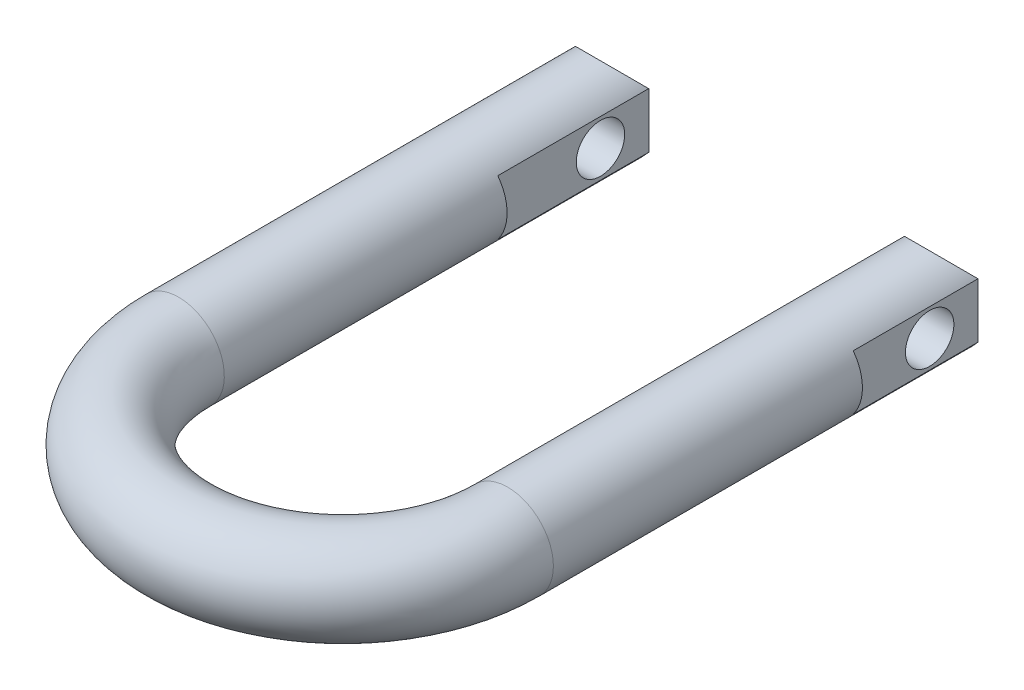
ISO-10303-21;
HEADER;
FILE_DESCRIPTION(('STEP AP214'),'2;1');
FILE_NAME('part.step','',(''),(''),'','','');
FILE_SCHEMA(('AUTOMOTIVE_DESIGN { 1 0 10303 214 1 1 1 1 }'));
ENDSEC;
DATA;
#1=APPLICATION_CONTEXT('core data for automotive mechanical design processes');
#2=APPLICATION_PROTOCOL_DEFINITION('international standard','automotive_design',2000,#1);
#3=PRODUCT_CONTEXT('',#1,'mechanical');
#4=PRODUCT('Part','Part','',(#3));
#5=PRODUCT_RELATED_PRODUCT_CATEGORY('part','',(#4));
#6=PRODUCT_DEFINITION_FORMATION('','',#4);
#7=PRODUCT_DEFINITION_CONTEXT('part definition',#1,'design');
#8=PRODUCT_DEFINITION('design','',#6,#7);
#9=PRODUCT_DEFINITION_SHAPE('','',#8);
#10=(LENGTH_UNIT() NAMED_UNIT(*) SI_UNIT(.MILLI.,.METRE.));
#11=(NAMED_UNIT(*) PLANE_ANGLE_UNIT() SI_UNIT($,.RADIAN.));
#12=(NAMED_UNIT(*) SI_UNIT($,.STERADIAN.) SOLID_ANGLE_UNIT());
#13=UNCERTAINTY_MEASURE_WITH_UNIT(LENGTH_MEASURE(1.E-05),#10,'distance_accuracy_value','');
#14=(GEOMETRIC_REPRESENTATION_CONTEXT(3) GLOBAL_UNCERTAINTY_ASSIGNED_CONTEXT((#13)) GLOBAL_UNIT_ASSIGNED_CONTEXT((#10,
#11,#12)) REPRESENTATION_CONTEXT('',''));
#15=CARTESIAN_POINT('',(0.,0.,0.));
#16=DIRECTION('',(0.,0.,1.));
#17=DIRECTION('',(1.,0.,0.));
#18=AXIS2_PLACEMENT_3D('',#15,#16,#17);
#19=CARTESIAN_POINT('',(97.3,-13.9,37.));
#20=DIRECTION('',(-1.,0.,0.));
#21=DIRECTION('',(0.,-1.,0.));
#22=AXIS2_PLACEMENT_3D('',#19,#20,#21);
#23=PLANE('',#22);
#24=DIRECTION('',(0.,0.,-1.));
#25=VECTOR('',#24,1.);
#26=CARTESIAN_POINT('',(97.3,-13.2999060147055,186.6));
#27=LINE('',#26,#25);
#28=CARTESIAN_POINT('',(97.3,-13.2999060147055,37.));
#29=VERTEX_POINT('',#28);
#30=CARTESIAN_POINT('',(97.3,-13.2999060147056,-23.4));
#31=VERTEX_POINT('',#30);
#32=EDGE_CURVE('E127',#29,#31,#27,.T.);
#33=ORIENTED_EDGE('',*,*,#32,.T.);
#34=DIRECTION('',(0.,1.,0.));
#35=VECTOR('',#34,1.);
#36=CARTESIAN_POINT('',(97.3,-13.9,-23.4));
#37=LINE('',#36,#35);
#38=CARTESIAN_POINT('',(97.3,13.2999060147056,-23.4));
#39=VERTEX_POINT('',#38);
#40=EDGE_CURVE('E141',#31,#39,#37,.T.);
#41=ORIENTED_EDGE('',*,*,#40,.T.);
#42=DIRECTION('',(0.,0.,-1.));
#43=VECTOR('',#42,1.);
#44=CARTESIAN_POINT('',(97.3,13.2999060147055,186.6));
#45=LINE('',#44,#43);
#46=CARTESIAN_POINT('',(97.3,13.2999060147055,37.));
#47=VERTEX_POINT('',#46);
#48=EDGE_CURVE('E116',#39,#47,#45,.F.);
#49=ORIENTED_EDGE('',*,*,#48,.T.);
#50=DIRECTION('',(0.,1.,0.));
#51=VECTOR('',#50,1.);
#52=CARTESIAN_POINT('',(97.3,-13.9,37.));
#53=LINE('',#52,#51);
#54=EDGE_CURVE('E147',#29,#47,#53,.T.);
#55=ORIENTED_EDGE('',*,*,#54,.F.);
#56=EDGE_LOOP('',(#33,#41,#49,#55));
#57=FACE_BOUND('',#56,.T.);
#58=CARTESIAN_POINT('',(97.3,0.,0.));
#59=DIRECTION('',(-1.,0.,0.));
#60=DIRECTION('',(0.,0.,1.));
#61=AXIS2_PLACEMENT_3D('',#58,#59,#60);
#62=CIRCLE('',#61,11.72);
#63=CARTESIAN_POINT('',(97.3,0.,11.72));
#64=VERTEX_POINT('',#63);
#65=EDGE_CURVE('E506',#64,#64,#62,.T.);
#66=ORIENTED_EDGE('',*,*,#65,.T.);
#67=EDGE_LOOP('',(#66));
#68=FACE_BOUND('',#67,.T.);
#69=ADVANCED_FACE('F14',(#57,#68),#23,.F.);
#70=CARTESIAN_POINT('',(79.65,0.,186.6));
#71=DIRECTION('',(0.,0.,-1.));
#72=DIRECTION('',(1.,0.,0.));
#73=AXIS2_PLACEMENT_3D('',#70,#71,#72);
#74=CYLINDRICAL_SURFACE('',#73,22.1);
#75=CARTESIAN_POINT('',(79.65,0.,186.6));
#76=DIRECTION('',(0.,0.,-1.));
#77=DIRECTION('',(0.,-1.,0.));
#78=AXIS2_PLACEMENT_3D('',#75,#76,#77);
#79=CIRCLE('',#78,22.1);
#80=CARTESIAN_POINT('',(101.75,0.,186.6));
#81=VERTEX_POINT('',#80);
#82=EDGE_CURVE('E157',#81,#81,#79,.T.);
#83=ORIENTED_EDGE('',*,*,#82,.T.);
#84=EDGE_LOOP('',(#83));
#85=FACE_BOUND('',#84,.T.);
#86=ORIENTED_EDGE('',*,*,#48,.F.);
#87=CARTESIAN_POINT('',(79.65,0.,-36.6999060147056));
#88=DIRECTION('',(0.,0.707106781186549,-0.707106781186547));
#89=DIRECTION('',(0.,-0.707106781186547,-0.707106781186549));
#90=AXIS2_PLACEMENT_3D('',#87,#88,#89);
#91=ELLIPSE('',#90,31.2541197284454,22.1);
#92=CARTESIAN_POINT('',(62.1,13.4315859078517,-23.2683201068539));
#93=VERTEX_POINT('',#92);
#94=EDGE_CURVE('E120',#39,#93,#91,.F.);
#95=ORIENTED_EDGE('',*,*,#94,.T.);
#96=DIRECTION('',(0.,0.,-1.));
#97=VECTOR('',#96,1.);
#98=CARTESIAN_POINT('',(62.1,13.4315859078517,186.6));
#99=LINE('',#98,#97);
#100=CARTESIAN_POINT('',(62.1,13.4315859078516,-23.4));
#101=VERTEX_POINT('',#100);
#102=EDGE_CURVE('E135',#101,#93,#99,.F.);
#103=ORIENTED_EDGE('',*,*,#102,.F.);
#104=CARTESIAN_POINT('',(79.65,0.,-23.4));
#105=DIRECTION('',(0.,0.,-1.));
#106=DIRECTION('',(0.,-1.,0.));
#107=AXIS2_PLACEMENT_3D('',#104,#105,#106);
#108=CIRCLE('',#107,22.1);
#109=CARTESIAN_POINT('',(62.05,13.3660016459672,-23.4));
#110=VERTEX_POINT('',#109);
#111=EDGE_CURVE('E126',#110,#101,#108,.T.);
#112=ORIENTED_EDGE('',*,*,#111,.F.);
#113=DIRECTION('',(0.,0.,-1.));
#114=VECTOR('',#113,1.);
#115=CARTESIAN_POINT('',(62.05,13.3660016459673,186.6));
#116=LINE('',#115,#114);
#117=CARTESIAN_POINT('',(62.05,13.3660016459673,49.7));
#118=VERTEX_POINT('',#117);
#119=EDGE_CURVE('E150',#110,#118,#116,.F.);
#120=ORIENTED_EDGE('',*,*,#119,.T.);
#121=CARTESIAN_POINT('',(79.65,0.,49.7));
#122=DIRECTION('',(0.,0.,1.));
#123=DIRECTION('',(0.,-1.,0.));
#124=AXIS2_PLACEMENT_3D('',#121,#122,#123);
#125=CIRCLE('',#124,22.1);
#126=CARTESIAN_POINT('',(62.05,-13.3660016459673,49.7));
#127=VERTEX_POINT('',#126);
#128=EDGE_CURVE('E9',#127,#118,#125,.F.);
#129=ORIENTED_EDGE('',*,*,#128,.F.);
#130=DIRECTION('',(0.,0.,-1.));
#131=VECTOR('',#130,1.);
#132=CARTESIAN_POINT('',(62.05,-13.3660016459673,186.6));
#133=LINE('',#132,#131);
#134=CARTESIAN_POINT('',(62.05,-13.3660016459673,-23.4));
#135=VERTEX_POINT('',#134);
#136=EDGE_CURVE('E362',#127,#135,#133,.T.);
#137=ORIENTED_EDGE('',*,*,#136,.T.);
#138=CARTESIAN_POINT('',(62.1,-13.4315859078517,-23.4));
#139=VERTEX_POINT('',#138);
#140=EDGE_CURVE('E155',#139,#135,#108,.T.);
#141=ORIENTED_EDGE('',*,*,#140,.F.);
#142=DIRECTION('',(0.,0.,-1.));
#143=VECTOR('',#142,1.);
#144=CARTESIAN_POINT('',(62.1,-13.4315859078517,186.6));
#145=LINE('',#144,#143);
#146=CARTESIAN_POINT('',(62.1,-13.4315859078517,-23.2683201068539));
#147=VERTEX_POINT('',#146);
#148=EDGE_CURVE('E38',#139,#147,#145,.F.);
#149=ORIENTED_EDGE('',*,*,#148,.T.);
#150=CARTESIAN_POINT('',(79.65,0.,-36.6999060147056));
#151=DIRECTION('',(0.,0.707106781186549,0.707106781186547));
#152=DIRECTION('',(0.,0.707106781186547,-0.707106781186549));
#153=AXIS2_PLACEMENT_3D('',#150,#151,#152);
#154=ELLIPSE('',#153,31.2541197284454,22.1);
#155=EDGE_CURVE('E355',#31,#147,#154,.F.);
#156=ORIENTED_EDGE('',*,*,#155,.F.);
#157=ORIENTED_EDGE('',*,*,#32,.F.);
#158=CARTESIAN_POINT('',(79.65,0.,37.));
#159=DIRECTION('',(0.,0.,-1.));
#160=DIRECTION('',(0.,1.,0.));
#161=AXIS2_PLACEMENT_3D('',#158,#159,#160);
#162=CIRCLE('',#161,22.1);
#163=EDGE_CURVE('E23',#29,#47,#162,.F.);
#164=ORIENTED_EDGE('',*,*,#163,.T.);
#165=EDGE_LOOP('',(#86,#95,#103,#112,#120,#129,#137,#141,#149,#156,#157,#164));
#166=FACE_BOUND('',#165,.T.);
#167=ADVANCED_FACE('F118',(#85,#166),#74,.T.);
#168=CARTESIAN_POINT('',(79.65,0.,-23.4));
#169=DIRECTION('',(0.,0.,-1.));
#170=DIRECTION('',(0.,1.,0.));
#171=AXIS2_PLACEMENT_3D('',#168,#169,#170);
#172=PLANE('',#171);
#173=DIRECTION('',(0.,1.,0.));
#174=VECTOR('',#173,1.);
#175=CARTESIAN_POINT('',(62.1,13.2999060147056,-23.4));
#176=LINE('',#175,#174);
#177=CARTESIAN_POINT('',(62.1,13.2999060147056,-23.4));
#178=VERTEX_POINT('',#177);
#179=EDGE_CURVE('E143',#178,#101,#176,.T.);
#180=ORIENTED_EDGE('',*,*,#179,.F.);
#181=DIRECTION('',(1.,0.,0.));
#182=VECTOR('',#181,1.);
#183=CARTESIAN_POINT('',(62.1,13.2999060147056,-23.4));
#184=LINE('',#183,#182);
#185=EDGE_CURVE('E132',#178,#39,#184,.T.);
#186=ORIENTED_EDGE('',*,*,#185,.T.);
#187=ORIENTED_EDGE('',*,*,#40,.F.);
#188=DIRECTION('',(1.,0.,0.));
#189=VECTOR('',#188,1.);
#190=CARTESIAN_POINT('',(62.1,-13.2999060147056,-23.4));
#191=LINE('',#190,#189);
#192=CARTESIAN_POINT('',(62.1,-13.2999060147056,-23.4));
#193=VERTEX_POINT('',#192);
#194=EDGE_CURVE('E352',#193,#31,#191,.T.);
#195=ORIENTED_EDGE('',*,*,#194,.F.);
#196=DIRECTION('',(0.,-1.,0.));
#197=VECTOR('',#196,1.);
#198=CARTESIAN_POINT('',(62.1,-13.2999060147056,-23.4));
#199=LINE('',#198,#197);
#200=EDGE_CURVE('E134',#193,#139,#199,.T.);
#201=ORIENTED_EDGE('',*,*,#200,.T.);
#202=ORIENTED_EDGE('',*,*,#140,.T.);
#203=DIRECTION('',(0.,1.,0.));
#204=VECTOR('',#203,1.);
#205=CARTESIAN_POINT('',(62.05,-13.9,-23.4));
#206=LINE('',#205,#204);
#207=EDGE_CURVE('E357',#135,#110,#206,.T.);
#208=ORIENTED_EDGE('',*,*,#207,.T.);
#209=ORIENTED_EDGE('',*,*,#111,.T.);
#210=EDGE_LOOP('',(#180,#186,#187,#195,#201,#202,#208,#209));
#211=FACE_BOUND('',#210,.T.);
#212=ADVANCED_FACE('F139',(#211),#172,.T.);
#213=CARTESIAN_POINT('',(62.05,13.9,-23.4));
#214=DIRECTION('',(-1.,0.,0.));
#215=DIRECTION('',(0.,-1.,0.));
#216=AXIS2_PLACEMENT_3D('',#213,#214,#215);
#217=PLANE('',#216);
#218=ORIENTED_EDGE('',*,*,#207,.F.);
#219=ORIENTED_EDGE('',*,*,#136,.F.);
#220=DIRECTION('',(0.,1.,0.));
#221=VECTOR('',#220,1.);
#222=CARTESIAN_POINT('',(62.05,-13.9,49.7));
#223=LINE('',#222,#221);
#224=EDGE_CURVE('E360',#127,#118,#223,.T.);
#225=ORIENTED_EDGE('',*,*,#224,.T.);
#226=ORIENTED_EDGE('',*,*,#119,.F.);
#227=EDGE_LOOP('',(#218,#219,#225,#226));
#228=FACE_BOUND('',#227,.T.);
#229=CARTESIAN_POINT('',(62.05,0.,0.));
#230=DIRECTION('',(-1.,0.,0.));
#231=DIRECTION('',(0.,-1.,0.));
#232=AXIS2_PLACEMENT_3D('',#229,#230,#231);
#233=CIRCLE('',#232,11.72);
#234=CARTESIAN_POINT('',(62.05,-11.72,0.));
#235=VERTEX_POINT('',#234);
#236=EDGE_CURVE('E18',#235,#235,#233,.F.);
#237=ORIENTED_EDGE('',*,*,#236,.T.);
#238=EDGE_LOOP('',(#237));
#239=FACE_BOUND('',#238,.T.);
#240=ADVANCED_FACE('F260',(#228,#239),#217,.T.);
#241=CARTESIAN_POINT('',(-97.3,13.9,37.));
#242=DIRECTION('',(-1.,0.,0.));
#243=DIRECTION('',(0.,-1.,0.));
#244=AXIS2_PLACEMENT_3D('',#241,#242,#243);
#245=PLANE('',#244);
#246=DIRECTION('',(0.,0.,-1.));
#247=VECTOR('',#246,1.);
#248=CARTESIAN_POINT('',(-97.3,-13.2999060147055,186.6));
#249=LINE('',#248,#247);
#250=CARTESIAN_POINT('',(-97.3,-13.2999060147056,-23.4));
#251=VERTEX_POINT('',#250);
#252=CARTESIAN_POINT('',(-97.3,-13.2999060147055,37.));
#253=VERTEX_POINT('',#252);
#254=EDGE_CURVE('E203',#251,#253,#249,.F.);
#255=ORIENTED_EDGE('',*,*,#254,.T.);
#256=DIRECTION('',(0.,1.,0.));
#257=VECTOR('',#256,1.);
#258=CARTESIAN_POINT('',(-97.3,-13.9,37.));
#259=LINE('',#258,#257);
#260=CARTESIAN_POINT('',(-97.3,13.2999060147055,37.));
#261=VERTEX_POINT('',#260);
#262=EDGE_CURVE('E199',#253,#261,#259,.T.);
#263=ORIENTED_EDGE('',*,*,#262,.T.);
#264=DIRECTION('',(0.,0.,-1.));
#265=VECTOR('',#264,1.);
#266=CARTESIAN_POINT('',(-97.3,13.2999060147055,186.6));
#267=LINE('',#266,#265);
#268=CARTESIAN_POINT('',(-97.3,13.2999060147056,-23.4));
#269=VERTEX_POINT('',#268);
#270=EDGE_CURVE('E207',#261,#269,#267,.T.);
#271=ORIENTED_EDGE('',*,*,#270,.T.);
#272=DIRECTION('',(0.,1.,0.));
#273=VECTOR('',#272,1.);
#274=CARTESIAN_POINT('',(-97.3,-13.9,-23.4));
#275=LINE('',#274,#273);
#276=EDGE_CURVE('E200',#251,#269,#275,.T.);
#277=ORIENTED_EDGE('',*,*,#276,.F.);
#278=EDGE_LOOP('',(#255,#263,#271,#277));
#279=FACE_BOUND('',#278,.T.);
#280=CARTESIAN_POINT('',(-97.3,0.,0.));
#281=DIRECTION('',(1.,0.,0.));
#282=DIRECTION('',(0.,0.,-1.));
#283=AXIS2_PLACEMENT_3D('',#280,#281,#282);
#284=CIRCLE('',#283,11.72);
#285=CARTESIAN_POINT('',(-97.3,0.,-11.72));
#286=VERTEX_POINT('',#285);
#287=EDGE_CURVE('E507',#286,#286,#284,.F.);
#288=ORIENTED_EDGE('',*,*,#287,.F.);
#289=EDGE_LOOP('',(#288));
#290=FACE_BOUND('',#289,.T.);
#291=ADVANCED_FACE('F295',(#279,#290),#245,.T.);
#292=CARTESIAN_POINT('',(-79.65,0.,186.6));
#293=DIRECTION('',(0.,0.,-1.));
#294=DIRECTION('',(1.,0.,0.));
#295=AXIS2_PLACEMENT_3D('',#292,#293,#294);
#296=CYLINDRICAL_SURFACE('',#295,22.1);
#297=CARTESIAN_POINT('',(-79.65,0.,186.6));
#298=DIRECTION('',(0.,0.,1.));
#299=DIRECTION('',(0.,-1.,0.));
#300=AXIS2_PLACEMENT_3D('',#297,#298,#299);
#301=CIRCLE('',#300,22.1);
#302=CARTESIAN_POINT('',(-101.75,0.,186.6));
#303=VERTEX_POINT('',#302);
#304=EDGE_CURVE('E212',#303,#303,#301,.T.);
#305=ORIENTED_EDGE('',*,*,#304,.F.);
#306=EDGE_LOOP('',(#305));
#307=FACE_BOUND('',#306,.T.);
#308=CARTESIAN_POINT('',(-79.65,0.,-36.6999060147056));
#309=DIRECTION('',(0.,-0.707106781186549,0.707106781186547));
#310=DIRECTION('',(0.,-0.707106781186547,-0.707106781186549));
#311=AXIS2_PLACEMENT_3D('',#308,#309,#310);
#312=ELLIPSE('',#311,31.2541197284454,22.1);
#313=CARTESIAN_POINT('',(-62.1,13.4315859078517,-23.2683201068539));
#314=VERTEX_POINT('',#313);
#315=EDGE_CURVE('E171',#314,#269,#312,.T.);
#316=ORIENTED_EDGE('',*,*,#315,.T.);
#317=ORIENTED_EDGE('',*,*,#270,.F.);
#318=CARTESIAN_POINT('',(-79.65,0.,37.));
#319=DIRECTION('',(0.,0.,1.));
#320=DIRECTION('',(0.,-1.,0.));
#321=AXIS2_PLACEMENT_3D('',#318,#319,#320);
#322=CIRCLE('',#321,22.1);
#323=EDGE_CURVE('E215',#261,#253,#322,.T.);
#324=ORIENTED_EDGE('',*,*,#323,.T.);
#325=ORIENTED_EDGE('',*,*,#254,.F.);
#326=CARTESIAN_POINT('',(-79.65,0.,-36.6999060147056));
#327=DIRECTION('',(0.,-0.707106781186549,-0.707106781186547));
#328=DIRECTION('',(0.,0.707106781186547,-0.707106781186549));
#329=AXIS2_PLACEMENT_3D('',#326,#327,#328);
#330=ELLIPSE('',#329,31.2541197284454,22.1);
#331=CARTESIAN_POINT('',(-62.1,-13.4315859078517,-23.2683201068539));
#332=VERTEX_POINT('',#331);
#333=EDGE_CURVE('E185',#332,#251,#330,.T.);
#334=ORIENTED_EDGE('',*,*,#333,.F.);
#335=DIRECTION('',(0.,0.,-1.));
#336=VECTOR('',#335,1.);
#337=CARTESIAN_POINT('',(-62.1,-13.4315859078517,186.6));
#338=LINE('',#337,#336);
#339=CARTESIAN_POINT('',(-62.1,-13.4315859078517,-23.4));
#340=VERTEX_POINT('',#339);
#341=EDGE_CURVE('E182',#332,#340,#338,.T.);
#342=ORIENTED_EDGE('',*,*,#341,.T.);
#343=CARTESIAN_POINT('',(-79.65,0.,-23.4));
#344=DIRECTION('',(0.,0.,1.));
#345=DIRECTION('',(0.,-1.,0.));
#346=AXIS2_PLACEMENT_3D('',#343,#344,#345);
#347=CIRCLE('',#346,22.1);
#348=CARTESIAN_POINT('',(-62.05,-13.3660016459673,-23.4));
#349=VERTEX_POINT('',#348);
#350=EDGE_CURVE('E210',#340,#349,#347,.T.);
#351=ORIENTED_EDGE('',*,*,#350,.T.);
#352=DIRECTION('',(0.,0.,-1.));
#353=VECTOR('',#352,1.);
#354=CARTESIAN_POINT('',(-62.05,-13.3660016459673,186.6));
#355=LINE('',#354,#353);
#356=CARTESIAN_POINT('',(-62.05,-13.3660016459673,49.7));
#357=VERTEX_POINT('',#356);
#358=EDGE_CURVE('E190',#349,#357,#355,.F.);
#359=ORIENTED_EDGE('',*,*,#358,.T.);
#360=CARTESIAN_POINT('',(-79.65,0.,49.7));
#361=DIRECTION('',(0.,0.,-1.));
#362=DIRECTION('',(0.,1.,0.));
#363=AXIS2_PLACEMENT_3D('',#360,#361,#362);
#364=CIRCLE('',#363,22.1);
#365=CARTESIAN_POINT('',(-62.05,13.3660016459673,49.7));
#366=VERTEX_POINT('',#365);
#367=EDGE_CURVE('E218',#366,#357,#364,.T.);
#368=ORIENTED_EDGE('',*,*,#367,.F.);
#369=DIRECTION('',(0.,0.,-1.));
#370=VECTOR('',#369,1.);
#371=CARTESIAN_POINT('',(-62.05,13.3660016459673,186.6));
#372=LINE('',#371,#370);
#373=CARTESIAN_POINT('',(-62.05,13.3660016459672,-23.4));
#374=VERTEX_POINT('',#373);
#375=EDGE_CURVE('E196',#366,#374,#372,.T.);
#376=ORIENTED_EDGE('',*,*,#375,.T.);
#377=CARTESIAN_POINT('',(-62.1,13.4315859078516,-23.4));
#378=VERTEX_POINT('',#377);
#379=EDGE_CURVE('E209',#374,#378,#347,.T.);
#380=ORIENTED_EDGE('',*,*,#379,.T.);
#381=DIRECTION('',(0.,0.,-1.));
#382=VECTOR('',#381,1.);
#383=CARTESIAN_POINT('',(-62.1,13.4315859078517,186.6));
#384=LINE('',#383,#382);
#385=EDGE_CURVE('E169',#314,#378,#384,.T.);
#386=ORIENTED_EDGE('',*,*,#385,.F.);
#387=EDGE_LOOP('',(#316,#317,#324,#325,#334,#342,#351,#359,#368,#376,#380,#386));
#388=FACE_BOUND('',#387,.T.);
#389=ADVANCED_FACE('F284',(#307,#388),#296,.T.);
#390=CARTESIAN_POINT('',(-79.65,0.,-23.4));
#391=DIRECTION('',(0.,0.,1.));
#392=DIRECTION('',(0.,-1.,0.));
#393=AXIS2_PLACEMENT_3D('',#390,#391,#392);
#394=PLANE('',#393);
#395=ORIENTED_EDGE('',*,*,#276,.T.);
#396=DIRECTION('',(-1.,0.,0.));
#397=VECTOR('',#396,1.);
#398=CARTESIAN_POINT('',(-62.1,13.2999060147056,-23.4));
#399=LINE('',#398,#397);
#400=CARTESIAN_POINT('',(-62.1,13.2999060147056,-23.4));
#401=VERTEX_POINT('',#400);
#402=EDGE_CURVE('E164',#401,#269,#399,.T.);
#403=ORIENTED_EDGE('',*,*,#402,.F.);
#404=DIRECTION('',(0.,1.,0.));
#405=VECTOR('',#404,1.);
#406=CARTESIAN_POINT('',(-62.1,13.2999060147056,-23.4));
#407=LINE('',#406,#405);
#408=EDGE_CURVE('E161',#401,#378,#407,.T.);
#409=ORIENTED_EDGE('',*,*,#408,.T.);
#410=ORIENTED_EDGE('',*,*,#379,.F.);
#411=DIRECTION('',(0.,1.,0.));
#412=VECTOR('',#411,1.);
#413=CARTESIAN_POINT('',(-62.05,-13.9,-23.4));
#414=LINE('',#413,#412);
#415=EDGE_CURVE('E188',#349,#374,#414,.T.);
#416=ORIENTED_EDGE('',*,*,#415,.F.);
#417=ORIENTED_EDGE('',*,*,#350,.F.);
#418=DIRECTION('',(0.,-1.,0.));
#419=VECTOR('',#418,1.);
#420=CARTESIAN_POINT('',(-62.1,-13.2999060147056,-23.4));
#421=LINE('',#420,#419);
#422=CARTESIAN_POINT('',(-62.1,-13.2999060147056,-23.4));
#423=VERTEX_POINT('',#422);
#424=EDGE_CURVE('E175',#423,#340,#421,.T.);
#425=ORIENTED_EDGE('',*,*,#424,.F.);
#426=DIRECTION('',(-1.,0.,0.));
#427=VECTOR('',#426,1.);
#428=CARTESIAN_POINT('',(-62.1,-13.2999060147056,-23.4));
#429=LINE('',#428,#427);
#430=EDGE_CURVE('E177',#423,#251,#429,.T.);
#431=ORIENTED_EDGE('',*,*,#430,.T.);
#432=EDGE_LOOP('',(#395,#403,#409,#410,#416,#417,#425,#431));
#433=FACE_BOUND('',#432,.T.);
#434=ADVANCED_FACE('F279',(#433),#394,.F.);
#435=CARTESIAN_POINT('',(0.,0.,186.6));
#436=DIRECTION('',(0.,1.,0.));
#437=DIRECTION('',(-1.,0.,0.));
#438=AXIS2_PLACEMENT_3D('',#435,#436,#437);
#439=TOROIDAL_SURFACE('',#438,79.65,22.1);
#440=CARTESIAN_POINT('',(0.,0.,186.6));
#441=DIRECTION('',(0.,1.,0.));
#442=DIRECTION('',(-1.,0.,0.));
#443=AXIS2_PLACEMENT_3D('',#440,#441,#442);
#444=CIRCLE('',#443,101.75);
#445=EDGE_CURVE('',#303,#81,#444,.T.);
#446=ORIENTED_EDGE('',*,*,#304,.T.);
#447=ORIENTED_EDGE('',*,*,#82,.F.);
#448=ORIENTED_EDGE('',*,*,#445,.T.);
#449=ORIENTED_EDGE('',*,*,#445,.F.);
#450=EDGE_LOOP('',(#446,#448,#447,#449));
#451=FACE_BOUND('',#450,.T.);
#452=ADVANCED_FACE('F16',(#451),#439,.T.);
#453=CARTESIAN_POINT('',(-97.3,-13.9,37.));
#454=DIRECTION('',(0.,0.,1.));
#455=DIRECTION('',(0.,-1.,0.));
#456=AXIS2_PLACEMENT_3D('',#453,#454,#455);
#457=PLANE('',#456);
#458=ORIENTED_EDGE('',*,*,#262,.F.);
#459=ORIENTED_EDGE('',*,*,#323,.F.);
#460=EDGE_LOOP('',(#458,#459));
#461=FACE_BOUND('',#460,.T.);
#462=ADVANCED_FACE('F299',(#461),#457,.F.);
#463=CARTESIAN_POINT('',(-62.05,-13.9,49.7));
#464=DIRECTION('',(0.,0.,-1.));
#465=DIRECTION('',(0.,1.,0.));
#466=AXIS2_PLACEMENT_3D('',#463,#464,#465);
#467=PLANE('',#466);
#468=DIRECTION('',(0.,1.,0.));
#469=VECTOR('',#468,1.);
#470=CARTESIAN_POINT('',(-62.05,-13.9,49.7));
#471=LINE('',#470,#469);
#472=EDGE_CURVE('E191',#357,#366,#471,.T.);
#473=ORIENTED_EDGE('',*,*,#472,.T.);
#474=ORIENTED_EDGE('',*,*,#367,.T.);
#475=EDGE_LOOP('',(#473,#474));
#476=FACE_BOUND('',#475,.T.);
#477=ADVANCED_FACE('F240',(#476),#467,.T.);
#478=CARTESIAN_POINT('',(-62.05,13.9,49.7));
#479=DIRECTION('',(-1.,0.,0.));
#480=DIRECTION('',(0.,-1.,0.));
#481=AXIS2_PLACEMENT_3D('',#478,#479,#480);
#482=PLANE('',#481);
#483=CARTESIAN_POINT('',(-62.05,0.,0.));
#484=DIRECTION('',(-1.,0.,0.));
#485=DIRECTION('',(0.,-1.,0.));
#486=AXIS2_PLACEMENT_3D('',#483,#484,#485);
#487=CIRCLE('',#486,11.72);
#488=CARTESIAN_POINT('',(-62.05,-11.72,0.));
#489=VERTEX_POINT('',#488);
#490=EDGE_CURVE('E187',#489,#489,#487,.T.);
#491=ORIENTED_EDGE('',*,*,#490,.T.);
#492=EDGE_LOOP('',(#491));
#493=FACE_BOUND('',#492,.T.);
#494=ORIENTED_EDGE('',*,*,#472,.F.);
#495=ORIENTED_EDGE('',*,*,#358,.F.);
#496=ORIENTED_EDGE('',*,*,#415,.T.);
#497=ORIENTED_EDGE('',*,*,#375,.F.);
#498=EDGE_LOOP('',(#494,#495,#496,#497));
#499=FACE_BOUND('',#498,.T.);
#500=ADVANCED_FACE('F224',(#493,#499),#482,.F.);
#501=CARTESIAN_POINT('',(-61.9,0.,0.));
#502=DIRECTION('',(-1.,0.,0.));
#503=DIRECTION('',(0.,-1.,0.));
#504=AXIS2_PLACEMENT_3D('',#501,#502,#503);
#505=CYLINDRICAL_SURFACE('',#504,11.72);
#506=ORIENTED_EDGE('',*,*,#287,.T.);
#507=EDGE_LOOP('',(#506));
#508=FACE_BOUND('',#507,.T.);
#509=ORIENTED_EDGE('',*,*,#490,.F.);
#510=EDGE_LOOP('',(#509));
#511=FACE_BOUND('',#510,.T.);
#512=ADVANCED_FACE('F227',(#508,#511),#505,.F.);
#513=CARTESIAN_POINT('',(-62.1,-13.2999060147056,-23.4));
#514=DIRECTION('',(0.,-0.707106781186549,-0.707106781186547));
#515=DIRECTION('',(0.,0.707106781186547,-0.707106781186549));
#516=AXIS2_PLACEMENT_3D('',#513,#514,#515);
#517=PLANE('',#516);
#518=ORIENTED_EDGE('',*,*,#333,.T.);
#519=ORIENTED_EDGE('',*,*,#430,.F.);
#520=DIRECTION('',(0.,-0.707106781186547,0.707106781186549));
#521=VECTOR('',#520,1.);
#522=CARTESIAN_POINT('',(-62.1,-13.2999060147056,-23.4));
#523=LINE('',#522,#521);
#524=EDGE_CURVE('E174',#423,#332,#523,.T.);
#525=ORIENTED_EDGE('',*,*,#524,.T.);
#526=EDGE_LOOP('',(#518,#519,#525));
#527=FACE_BOUND('',#526,.T.);
#528=ADVANCED_FACE('F229',(#527),#517,.T.);
#529=CARTESIAN_POINT('',(-62.1,-22.1,-23.4));
#530=DIRECTION('',(1.,0.,0.));
#531=DIRECTION('',(0.,1.,0.));
#532=AXIS2_PLACEMENT_3D('',#529,#530,#531);
#533=PLANE('',#532);
#534=ORIENTED_EDGE('',*,*,#524,.F.);
#535=ORIENTED_EDGE('',*,*,#424,.T.);
#536=ORIENTED_EDGE('',*,*,#341,.F.);
#537=EDGE_LOOP('',(#534,#535,#536));
#538=FACE_BOUND('',#537,.T.);
#539=ADVANCED_FACE('F237',(#538),#533,.F.);
#540=CARTESIAN_POINT('',(-62.1,13.2999060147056,-23.4));
#541=DIRECTION('',(0.,-0.707106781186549,0.707106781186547));
#542=DIRECTION('',(0.,-0.707106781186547,-0.707106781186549));
#543=AXIS2_PLACEMENT_3D('',#540,#541,#542);
#544=PLANE('',#543);
#545=DIRECTION('',(0.,0.707106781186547,0.707106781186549));
#546=VECTOR('',#545,1.);
#547=CARTESIAN_POINT('',(-62.1,13.2999060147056,-23.4));
#548=LINE('',#547,#546);
#549=EDGE_CURVE('E160',#401,#314,#548,.T.);
#550=ORIENTED_EDGE('',*,*,#549,.F.);
#551=ORIENTED_EDGE('',*,*,#402,.T.);
#552=ORIENTED_EDGE('',*,*,#315,.F.);
#553=EDGE_LOOP('',(#550,#551,#552));
#554=FACE_BOUND('',#553,.T.);
#555=ADVANCED_FACE('F264',(#554),#544,.F.);
#556=CARTESIAN_POINT('',(-62.1,13.2999060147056,-23.4));
#557=DIRECTION('',(-1.,0.,0.));
#558=DIRECTION('',(0.,-1.,0.));
#559=AXIS2_PLACEMENT_3D('',#556,#557,#558);
#560=PLANE('',#559);
#561=ORIENTED_EDGE('',*,*,#385,.T.);
#562=ORIENTED_EDGE('',*,*,#408,.F.);
#563=ORIENTED_EDGE('',*,*,#549,.T.);
#564=EDGE_LOOP('',(#561,#562,#563));
#565=FACE_BOUND('',#564,.T.);
#566=ADVANCED_FACE('F257',(#565),#560,.T.);
#567=CARTESIAN_POINT('',(97.3,-13.9,37.));
#568=DIRECTION('',(0.,0.,-1.));
#569=DIRECTION('',(0.,1.,0.));
#570=AXIS2_PLACEMENT_3D('',#567,#568,#569);
#571=PLANE('',#570);
#572=ORIENTED_EDGE('',*,*,#54,.T.);
#573=ORIENTED_EDGE('',*,*,#163,.F.);
#574=EDGE_LOOP('',(#572,#573));
#575=FACE_BOUND('',#574,.T.);
#576=ADVANCED_FACE('F254',(#575),#571,.T.);
#577=CARTESIAN_POINT('',(62.05,-13.9,49.7));
#578=DIRECTION('',(0.,0.,1.));
#579=DIRECTION('',(0.,-1.,0.));
#580=AXIS2_PLACEMENT_3D('',#577,#578,#579);
#581=PLANE('',#580);
#582=ORIENTED_EDGE('',*,*,#224,.F.);
#583=ORIENTED_EDGE('',*,*,#128,.T.);
#584=EDGE_LOOP('',(#582,#583));
#585=FACE_BOUND('',#584,.T.);
#586=ADVANCED_FACE('F252',(#585),#581,.F.);
#587=CARTESIAN_POINT('',(61.9,0.,0.));
#588=DIRECTION('',(1.,0.,0.));
#589=DIRECTION('',(0.,1.,0.));
#590=AXIS2_PLACEMENT_3D('',#587,#588,#589);
#591=CYLINDRICAL_SURFACE('',#590,11.72);
#592=ORIENTED_EDGE('',*,*,#236,.F.);
#593=EDGE_LOOP('',(#592));
#594=FACE_BOUND('',#593,.T.);
#595=ORIENTED_EDGE('',*,*,#65,.F.);
#596=EDGE_LOOP('',(#595));
#597=FACE_BOUND('',#596,.T.);
#598=ADVANCED_FACE('F328',(#594,#597),#591,.F.);
#599=CARTESIAN_POINT('',(62.1,-13.2999060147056,-23.4));
#600=DIRECTION('',(0.,0.707106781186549,0.707106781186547));
#601=DIRECTION('',(0.,-0.707106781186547,0.707106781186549));
#602=AXIS2_PLACEMENT_3D('',#599,#600,#601);
#603=PLANE('',#602);
#604=ORIENTED_EDGE('',*,*,#155,.T.);
#605=DIRECTION('',(0.,-0.707106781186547,0.707106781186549));
#606=VECTOR('',#605,1.);
#607=CARTESIAN_POINT('',(62.1,-13.2999060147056,-23.4));
#608=LINE('',#607,#606);
#609=EDGE_CURVE('E350',#193,#147,#608,.T.);
#610=ORIENTED_EDGE('',*,*,#609,.F.);
#611=ORIENTED_EDGE('',*,*,#194,.T.);
#612=EDGE_LOOP('',(#604,#610,#611));
#613=FACE_BOUND('',#612,.T.);
#614=ADVANCED_FACE('F331',(#613),#603,.F.);
#615=CARTESIAN_POINT('',(62.1,-22.1,-23.4));
#616=DIRECTION('',(1.,0.,0.));
#617=DIRECTION('',(0.,1.,0.));
#618=AXIS2_PLACEMENT_3D('',#615,#616,#617);
#619=PLANE('',#618);
#620=ORIENTED_EDGE('',*,*,#200,.F.);
#621=ORIENTED_EDGE('',*,*,#609,.T.);
#622=ORIENTED_EDGE('',*,*,#148,.F.);
#623=EDGE_LOOP('',(#620,#621,#622));
#624=FACE_BOUND('',#623,.T.);
#625=ADVANCED_FACE('F335',(#624),#619,.T.);
#626=CARTESIAN_POINT('',(62.1,13.2999060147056,-23.4));
#627=DIRECTION('',(0.,0.707106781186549,-0.707106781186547));
#628=DIRECTION('',(0.,0.707106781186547,0.707106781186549));
#629=AXIS2_PLACEMENT_3D('',#626,#627,#628);
#630=PLANE('',#629);
#631=ORIENTED_EDGE('',*,*,#185,.F.);
#632=DIRECTION('',(0.,0.707106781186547,0.707106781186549));
#633=VECTOR('',#632,1.);
#634=CARTESIAN_POINT('',(62.1,13.2999060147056,-23.4));
#635=LINE('',#634,#633);
#636=EDGE_CURVE('E30',#178,#93,#635,.T.);
#637=ORIENTED_EDGE('',*,*,#636,.T.);
#638=ORIENTED_EDGE('',*,*,#94,.F.);
#639=EDGE_LOOP('',(#631,#637,#638));
#640=FACE_BOUND('',#639,.T.);
#641=ADVANCED_FACE('F131',(#640),#630,.T.);
#642=CARTESIAN_POINT('',(62.1,13.2999060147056,-23.4));
#643=DIRECTION('',(-1.,0.,0.));
#644=DIRECTION('',(0.,-1.,0.));
#645=AXIS2_PLACEMENT_3D('',#642,#643,#644);
#646=PLANE('',#645);
#647=ORIENTED_EDGE('',*,*,#102,.T.);
#648=ORIENTED_EDGE('',*,*,#636,.F.);
#649=ORIENTED_EDGE('',*,*,#179,.T.);
#650=EDGE_LOOP('',(#647,#648,#649));
#651=FACE_BOUND('',#650,.T.);
#652=ADVANCED_FACE('F341',(#651),#646,.F.);
#653=CLOSED_SHELL('',(#69,#167,#212,#240,#291,#389,#434,#452,#462,#477,#500,#512,#528,#539,#555,
#566,#576,#586,#598,#614,#625,#641,#652));
#654=MANIFOLD_SOLID_BREP('B1',#653);
#655=ADVANCED_BREP_SHAPE_REPRESENTATION('',(#18,#654),#14);
#656=SHAPE_DEFINITION_REPRESENTATION(#9,#655);
ENDSEC;
END-ISO-10303-21;
